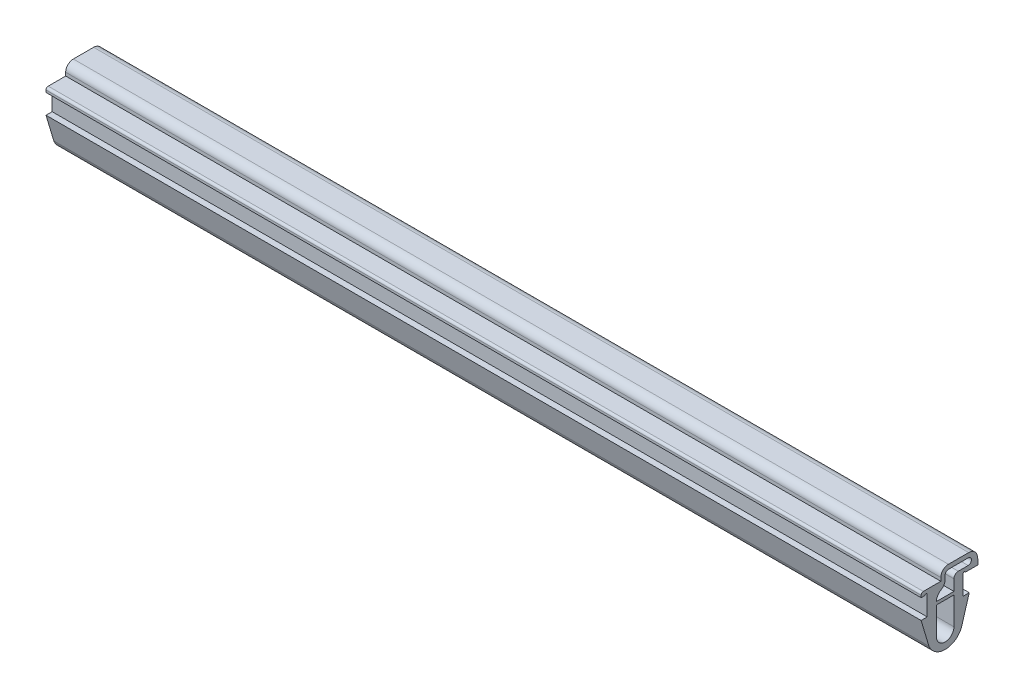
ISO-10303-21;
HEADER;
FILE_DESCRIPTION(('STEP AP214'),'2;1');
FILE_NAME('part.step','',(''),(''),'','','');
FILE_SCHEMA(('AUTOMOTIVE_DESIGN { 1 0 10303 214 1 1 1 1 }'));
ENDSEC;
DATA;
#1=APPLICATION_CONTEXT('core data for automotive mechanical design processes');
#2=APPLICATION_PROTOCOL_DEFINITION('international standard','automotive_design',2000,#1);
#3=PRODUCT_CONTEXT('',#1,'mechanical');
#4=PRODUCT('Part','Part','',(#3));
#5=PRODUCT_RELATED_PRODUCT_CATEGORY('part','',(#4));
#6=PRODUCT_DEFINITION_FORMATION('','',#4);
#7=PRODUCT_DEFINITION_CONTEXT('part definition',#1,'design');
#8=PRODUCT_DEFINITION('design','',#6,#7);
#9=PRODUCT_DEFINITION_SHAPE('','',#8);
#10=(LENGTH_UNIT() NAMED_UNIT(*) SI_UNIT(.MILLI.,.METRE.));
#11=(NAMED_UNIT(*) PLANE_ANGLE_UNIT() SI_UNIT($,.RADIAN.));
#12=(NAMED_UNIT(*) SI_UNIT($,.STERADIAN.) SOLID_ANGLE_UNIT());
#13=UNCERTAINTY_MEASURE_WITH_UNIT(LENGTH_MEASURE(1.E-05),#10,'distance_accuracy_value','');
#14=(GEOMETRIC_REPRESENTATION_CONTEXT(3) GLOBAL_UNCERTAINTY_ASSIGNED_CONTEXT((#13)) GLOBAL_UNIT_ASSIGNED_CONTEXT((#10,
#11,#12)) REPRESENTATION_CONTEXT('',''));
#15=CARTESIAN_POINT('',(0.,0.,0.));
#16=DIRECTION('',(0.,0.,1.));
#17=DIRECTION('',(1.,0.,0.));
#18=AXIS2_PLACEMENT_3D('',#15,#16,#17);
#19=CARTESIAN_POINT('',(200.,5.05334219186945,6.26221053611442));
#20=DIRECTION('',(-1.,0.,0.));
#21=DIRECTION('',(0.,0.,1.));
#22=AXIS2_PLACEMENT_3D('',#19,#20,#21);
#23=CYLINDRICAL_SURFACE('',#22,0.500000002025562);
#24=CARTESIAN_POINT('',(0.,5.05334219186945,6.26221053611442));
#25=DIRECTION('',(1.,0.,0.));
#26=DIRECTION('',(0.,0.,-1.));
#27=AXIS2_PLACEMENT_3D('',#24,#25,#26);
#28=CIRCLE('',#27,0.500000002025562);
#29=CARTESIAN_POINT('',(0.,5.55334219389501,6.26221053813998));
#30=VERTEX_POINT('',#29);
#31=CARTESIAN_POINT('',(0.,5.05334219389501,6.76221053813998));
#32=VERTEX_POINT('',#31);
#33=EDGE_CURVE('E427',#30,#32,#28,.T.);
#34=ORIENTED_EDGE('',*,*,#33,.T.);
#35=DIRECTION('',(-1.,0.,0.));
#36=VECTOR('',#35,1.);
#37=CARTESIAN_POINT('',(200.,5.05334219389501,6.76221053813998));
#38=LINE('',#37,#36);
#39=CARTESIAN_POINT('',(200.,5.05334219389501,6.76221053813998));
#40=VERTEX_POINT('',#39);
#41=EDGE_CURVE('E13',#40,#32,#38,.T.);
#42=ORIENTED_EDGE('',*,*,#41,.F.);
#43=CARTESIAN_POINT('',(200.,5.05334219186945,6.26221053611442));
#44=DIRECTION('',(1.,0.,0.));
#45=DIRECTION('',(0.,0.,-1.));
#46=AXIS2_PLACEMENT_3D('',#43,#44,#45);
#47=CIRCLE('',#46,0.500000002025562);
#48=CARTESIAN_POINT('',(200.,5.55334219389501,6.26221053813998));
#49=VERTEX_POINT('',#48);
#50=EDGE_CURVE('E660',#49,#40,#47,.T.);
#51=ORIENTED_EDGE('',*,*,#50,.F.);
#52=DIRECTION('',(-1.,0.,0.));
#53=VECTOR('',#52,1.);
#54=CARTESIAN_POINT('',(200.,5.55334219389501,6.26221053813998));
#55=LINE('',#54,#53);
#56=EDGE_CURVE('E486',#49,#30,#55,.T.);
#57=ORIENTED_EDGE('',*,*,#56,.T.);
#58=EDGE_LOOP('',(#34,#42,#51,#57));
#59=FACE_BOUND('',#58,.T.);
#60=ADVANCED_FACE('F110',(#59),#23,.T.);
#61=CARTESIAN_POINT('',(200.,5.05334219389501,6.76221053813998));
#62=DIRECTION('',(0.,0.,-1.));
#63=DIRECTION('',(-1.,0.,0.));
#64=AXIS2_PLACEMENT_3D('',#61,#62,#63);
#65=PLANE('',#64);
#66=DIRECTION('',(0.,-1.,0.));
#67=VECTOR('',#66,1.);
#68=CARTESIAN_POINT('',(0.,5.05334219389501,6.76221053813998));
#69=LINE('',#68,#67);
#70=CARTESIAN_POINT('',(0.,4.55334219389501,6.76221053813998));
#71=VERTEX_POINT('',#70);
#72=EDGE_CURVE('E431',#32,#71,#69,.T.);
#73=ORIENTED_EDGE('',*,*,#72,.T.);
#74=DIRECTION('',(-1.,0.,0.));
#75=VECTOR('',#74,1.);
#76=CARTESIAN_POINT('',(200.,4.55334219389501,6.76221053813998));
#77=LINE('',#76,#75);
#78=CARTESIAN_POINT('',(200.,4.55334219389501,6.76221053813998));
#79=VERTEX_POINT('',#78);
#80=EDGE_CURVE('E121',#79,#71,#77,.T.);
#81=ORIENTED_EDGE('',*,*,#80,.F.);
#82=DIRECTION('',(0.,-1.,0.));
#83=VECTOR('',#82,1.);
#84=CARTESIAN_POINT('',(200.,5.05334219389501,6.76221053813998));
#85=LINE('',#84,#83);
#86=EDGE_CURVE('E663',#40,#79,#85,.T.);
#87=ORIENTED_EDGE('',*,*,#86,.F.);
#88=ORIENTED_EDGE('',*,*,#41,.T.);
#89=EDGE_LOOP('',(#73,#81,#87,#88));
#90=FACE_BOUND('',#89,.T.);
#91=ADVANCED_FACE('F739',(#90),#65,.F.);
#92=CARTESIAN_POINT('',(200.,4.55334219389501,6.76221053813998));
#93=DIRECTION('',(0.,1.,0.));
#94=DIRECTION('',(0.,0.,1.));
#95=AXIS2_PLACEMENT_3D('',#92,#93,#94);
#96=PLANE('',#95);
#97=DIRECTION('',(0.,0.,-1.));
#98=VECTOR('',#97,1.);
#99=CARTESIAN_POINT('',(0.,4.55334219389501,6.76221053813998));
#100=LINE('',#99,#98);
#101=CARTESIAN_POINT('',(0.,4.55334219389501,5.86221639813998));
#102=VERTEX_POINT('',#101);
#103=EDGE_CURVE('E434',#71,#102,#100,.T.);
#104=ORIENTED_EDGE('',*,*,#103,.T.);
#105=DIRECTION('',(-1.,0.,0.));
#106=VECTOR('',#105,1.);
#107=CARTESIAN_POINT('',(200.,4.55334219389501,5.86221639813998));
#108=LINE('',#107,#106);
#109=CARTESIAN_POINT('',(200.,4.55334219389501,5.86221639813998));
#110=VERTEX_POINT('',#109);
#111=EDGE_CURVE('E546',#110,#102,#108,.T.);
#112=ORIENTED_EDGE('',*,*,#111,.F.);
#113=DIRECTION('',(0.,0.,-1.));
#114=VECTOR('',#113,1.);
#115=CARTESIAN_POINT('',(200.,4.55334219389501,6.76221053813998));
#116=LINE('',#115,#114);
#117=EDGE_CURVE('E666',#79,#110,#116,.T.);
#118=ORIENTED_EDGE('',*,*,#117,.F.);
#119=ORIENTED_EDGE('',*,*,#80,.T.);
#120=EDGE_LOOP('',(#104,#112,#118,#119));
#121=FACE_BOUND('',#120,.T.);
#122=ADVANCED_FACE('F744',(#121),#96,.F.);
#123=CARTESIAN_POINT('',(200.,4.55334219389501,5.61221639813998));
#124=DIRECTION('',(-1.,0.,0.));
#125=DIRECTION('',(0.,0.,1.));
#126=AXIS2_PLACEMENT_3D('',#123,#124,#125);
#127=CYLINDRICAL_SURFACE('',#126,0.249999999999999);
#128=CARTESIAN_POINT('',(0.,4.55334219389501,5.61221639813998));
#129=DIRECTION('',(-1.,0.,0.));
#130=DIRECTION('',(0.,0.,-1.));
#131=AXIS2_PLACEMENT_3D('',#128,#129,#130);
#132=CIRCLE('',#131,0.249999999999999);
#133=CARTESIAN_POINT('',(0.,4.55334219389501,5.36221639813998));
#134=VERTEX_POINT('',#133);
#135=EDGE_CURVE('E437',#102,#134,#132,.T.);
#136=ORIENTED_EDGE('',*,*,#135,.T.);
#137=DIRECTION('',(-1.,0.,0.));
#138=VECTOR('',#137,1.);
#139=CARTESIAN_POINT('',(200.,4.55334219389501,5.36221639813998));
#140=LINE('',#139,#138);
#141=CARTESIAN_POINT('',(200.,4.55334219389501,5.36221639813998));
#142=VERTEX_POINT('',#141);
#143=EDGE_CURVE('E542',#142,#134,#140,.T.);
#144=ORIENTED_EDGE('',*,*,#143,.F.);
#145=CARTESIAN_POINT('',(200.,4.55334219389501,5.61221639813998));
#146=DIRECTION('',(-1.,0.,0.));
#147=DIRECTION('',(0.,0.,-1.));
#148=AXIS2_PLACEMENT_3D('',#145,#146,#147);
#149=CIRCLE('',#148,0.249999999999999);
#150=EDGE_CURVE('E669',#110,#142,#149,.T.);
#151=ORIENTED_EDGE('',*,*,#150,.F.);
#152=ORIENTED_EDGE('',*,*,#111,.T.);
#153=EDGE_LOOP('',(#136,#144,#151,#152));
#154=FACE_BOUND('',#153,.T.);
#155=ADVANCED_FACE('F915',(#154),#127,.F.);
#156=CARTESIAN_POINT('',(200.,4.55334219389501,5.36221639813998));
#157=DIRECTION('',(0.,0.,-1.));
#158=DIRECTION('',(-1.,0.,0.));
#159=AXIS2_PLACEMENT_3D('',#156,#157,#158);
#160=PLANE('',#159);
#161=DIRECTION('',(0.,-1.,0.));
#162=VECTOR('',#161,1.);
#163=CARTESIAN_POINT('',(0.,4.55334219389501,5.36221639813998));
#164=LINE('',#163,#162);
#165=CARTESIAN_POINT('',(0.,0.0533421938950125,5.36221639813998));
#166=VERTEX_POINT('',#165);
#167=EDGE_CURVE('E440',#134,#166,#164,.T.);
#168=ORIENTED_EDGE('',*,*,#167,.T.);
#169=DIRECTION('',(-1.,0.,0.));
#170=VECTOR('',#169,1.);
#171=CARTESIAN_POINT('',(200.,0.0533421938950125,5.36221639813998));
#172=LINE('',#171,#170);
#173=CARTESIAN_POINT('',(200.,0.0533421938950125,5.36221639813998));
#174=VERTEX_POINT('',#173);
#175=EDGE_CURVE('E538',#174,#166,#172,.T.);
#176=ORIENTED_EDGE('',*,*,#175,.F.);
#177=DIRECTION('',(0.,-1.,0.));
#178=VECTOR('',#177,1.);
#179=CARTESIAN_POINT('',(200.,4.55334219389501,5.36221639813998));
#180=LINE('',#179,#178);
#181=EDGE_CURVE('E672',#142,#174,#180,.T.);
#182=ORIENTED_EDGE('',*,*,#181,.F.);
#183=ORIENTED_EDGE('',*,*,#143,.T.);
#184=EDGE_LOOP('',(#168,#176,#182,#183));
#185=FACE_BOUND('',#184,.T.);
#186=ADVANCED_FACE('F907',(#185),#160,.F.);
#187=CARTESIAN_POINT('',(200.,0.0533421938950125,5.36221639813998));
#188=DIRECTION('',(0.,-1.,0.));
#189=DIRECTION('',(0.,0.,-1.));
#190=AXIS2_PLACEMENT_3D('',#187,#188,#189);
#191=PLANE('',#190);
#192=DIRECTION('',(0.,0.,1.));
#193=VECTOR('',#192,1.);
#194=CARTESIAN_POINT('',(0.,0.0533421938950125,5.36221639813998));
#195=LINE('',#194,#193);
#196=CARTESIAN_POINT('',(0.,0.0533421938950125,6.76221029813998));
#197=VERTEX_POINT('',#196);
#198=EDGE_CURVE('E443',#166,#197,#195,.T.);
#199=ORIENTED_EDGE('',*,*,#198,.T.);
#200=DIRECTION('',(-1.,0.,0.));
#201=VECTOR('',#200,1.);
#202=CARTESIAN_POINT('',(200.,0.0533421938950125,6.76221029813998));
#203=LINE('',#202,#201);
#204=CARTESIAN_POINT('',(200.,0.0533421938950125,6.76221029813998));
#205=VERTEX_POINT('',#204);
#206=EDGE_CURVE('E534',#205,#197,#203,.T.);
#207=ORIENTED_EDGE('',*,*,#206,.F.);
#208=DIRECTION('',(0.,0.,1.));
#209=VECTOR('',#208,1.);
#210=CARTESIAN_POINT('',(200.,0.0533421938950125,5.36221639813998));
#211=LINE('',#210,#209);
#212=EDGE_CURVE('E675',#174,#205,#211,.T.);
#213=ORIENTED_EDGE('',*,*,#212,.F.);
#214=ORIENTED_EDGE('',*,*,#175,.T.);
#215=EDGE_LOOP('',(#199,#207,#213,#214));
#216=FACE_BOUND('',#215,.T.);
#217=ADVANCED_FACE('F899',(#216),#191,.F.);
#218=CARTESIAN_POINT('',(200.,0.0533421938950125,6.76221029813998));
#219=DIRECTION('',(0.,0.285855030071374,-0.958272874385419));
#220=DIRECTION('',(0.,0.95827287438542,0.285855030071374));
#221=AXIS2_PLACEMENT_3D('',#218,#219,#220);
#222=PLANE('',#221);
#223=DIRECTION('',(0.,-0.95827287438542,-0.285855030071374));
#224=VECTOR('',#223,1.);
#225=CARTESIAN_POINT('',(0.,0.0533421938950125,6.76221029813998));
#226=LINE('',#225,#224);
#227=CARTESIAN_POINT('',(0.,-5.92640706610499,4.97843716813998));
#228=VERTEX_POINT('',#227);
#229=EDGE_CURVE('E446',#197,#228,#226,.T.);
#230=ORIENTED_EDGE('',*,*,#229,.T.);
#231=DIRECTION('',(-1.,0.,0.));
#232=VECTOR('',#231,1.);
#233=CARTESIAN_POINT('',(200.,-5.92640706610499,4.97843716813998));
#234=LINE('',#233,#232);
#235=CARTESIAN_POINT('',(200.,-5.92640706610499,4.97843716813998));
#236=VERTEX_POINT('',#235);
#237=EDGE_CURVE('E530',#236,#228,#234,.T.);
#238=ORIENTED_EDGE('',*,*,#237,.F.);
#239=DIRECTION('',(0.,-0.95827287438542,-0.285855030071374));
#240=VECTOR('',#239,1.);
#241=CARTESIAN_POINT('',(200.,0.0533421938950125,6.76221029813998));
#242=LINE('',#241,#240);
#243=EDGE_CURVE('E678',#205,#236,#242,.T.);
#244=ORIENTED_EDGE('',*,*,#243,.F.);
#245=ORIENTED_EDGE('',*,*,#206,.T.);
#246=EDGE_LOOP('',(#230,#238,#244,#245));
#247=FACE_BOUND('',#246,.T.);
#248=ADVANCED_FACE('F891',(#247),#222,.F.);
#249=CARTESIAN_POINT('',(200.,-4.44665780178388,1.26221029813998));
#250=DIRECTION('',(-1.,0.,0.));
#251=DIRECTION('',(0.,0.,1.));
#252=AXIS2_PLACEMENT_3D('',#249,#250,#251);
#253=CYLINDRICAL_SURFACE('',#252,4.00000000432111);
#254=CARTESIAN_POINT('',(0.,-4.44665780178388,1.26221029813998));
#255=DIRECTION('',(1.,0.,0.));
#256=DIRECTION('',(0.,0.,-1.));
#257=AXIS2_PLACEMENT_3D('',#254,#255,#256);
#258=CIRCLE('',#257,4.00000000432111);
#259=CARTESIAN_POINT('',(0.,-5.92640706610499,-2.45401657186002));
#260=VERTEX_POINT('',#259);
#261=EDGE_CURVE('E449',#228,#260,#258,.T.);
#262=ORIENTED_EDGE('',*,*,#261,.T.);
#263=DIRECTION('',(-1.,0.,0.));
#264=VECTOR('',#263,1.);
#265=CARTESIAN_POINT('',(200.,-5.92640706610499,-2.45401657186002));
#266=LINE('',#265,#264);
#267=CARTESIAN_POINT('',(200.,-5.92640706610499,-2.45401657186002));
#268=VERTEX_POINT('',#267);
#269=EDGE_CURVE('E526',#268,#260,#266,.T.);
#270=ORIENTED_EDGE('',*,*,#269,.F.);
#271=CARTESIAN_POINT('',(200.,-4.44665780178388,1.26221029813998));
#272=DIRECTION('',(1.,0.,0.));
#273=DIRECTION('',(0.,0.,-1.));
#274=AXIS2_PLACEMENT_3D('',#271,#272,#273);
#275=CIRCLE('',#274,4.00000000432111);
#276=EDGE_CURVE('E681',#236,#268,#275,.T.);
#277=ORIENTED_EDGE('',*,*,#276,.F.);
#278=ORIENTED_EDGE('',*,*,#237,.T.);
#279=EDGE_LOOP('',(#262,#270,#277,#278));
#280=FACE_BOUND('',#279,.T.);
#281=ADVANCED_FACE('F883',(#280),#253,.T.);
#282=CARTESIAN_POINT('',(200.,-5.92640706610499,-2.45401657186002));
#283=DIRECTION('',(0.,0.285855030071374,0.95827287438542));
#284=DIRECTION('',(0.,-0.95827287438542,0.285855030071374));
#285=AXIS2_PLACEMENT_3D('',#282,#283,#284);
#286=PLANE('',#285);
#287=DIRECTION('',(0.,0.958272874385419,-0.285855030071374));
#288=VECTOR('',#287,1.);
#289=CARTESIAN_POINT('',(0.,-5.92640706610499,-2.45401657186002));
#290=LINE('',#289,#288);
#291=CARTESIAN_POINT('',(0.,0.0533421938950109,-4.23778970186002));
#292=VERTEX_POINT('',#291);
#293=EDGE_CURVE('E452',#260,#292,#290,.T.);
#294=ORIENTED_EDGE('',*,*,#293,.T.);
#295=DIRECTION('',(-1.,0.,0.));
#296=VECTOR('',#295,1.);
#297=CARTESIAN_POINT('',(200.,0.0533421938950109,-4.23778970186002));
#298=LINE('',#297,#296);
#299=CARTESIAN_POINT('',(200.,0.0533421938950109,-4.23778970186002));
#300=VERTEX_POINT('',#299);
#301=EDGE_CURVE('E522',#300,#292,#298,.T.);
#302=ORIENTED_EDGE('',*,*,#301,.F.);
#303=DIRECTION('',(0.,0.958272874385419,-0.285855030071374));
#304=VECTOR('',#303,1.);
#305=CARTESIAN_POINT('',(200.,-5.92640706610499,-2.45401657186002));
#306=LINE('',#305,#304);
#307=EDGE_CURVE('E684',#268,#300,#306,.T.);
#308=ORIENTED_EDGE('',*,*,#307,.F.);
#309=ORIENTED_EDGE('',*,*,#269,.T.);
#310=EDGE_LOOP('',(#294,#302,#308,#309));
#311=FACE_BOUND('',#310,.T.);
#312=ADVANCED_FACE('F875',(#311),#286,.F.);
#313=CARTESIAN_POINT('',(200.,0.0533421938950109,-4.23778970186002));
#314=DIRECTION('',(0.,-1.,0.));
#315=DIRECTION('',(0.,0.,-1.));
#316=AXIS2_PLACEMENT_3D('',#313,#314,#315);
#317=PLANE('',#316);
#318=DIRECTION('',(0.,0.,1.));
#319=VECTOR('',#318,1.);
#320=CARTESIAN_POINT('',(0.,0.0533421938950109,-4.23778970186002));
#321=LINE('',#320,#319);
#322=CARTESIAN_POINT('',(0.,0.0533421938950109,-2.83778817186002));
#323=VERTEX_POINT('',#322);
#324=EDGE_CURVE('E455',#292,#323,#321,.T.);
#325=ORIENTED_EDGE('',*,*,#324,.T.);
#326=DIRECTION('',(-1.,0.,0.));
#327=VECTOR('',#326,1.);
#328=CARTESIAN_POINT('',(200.,0.0533421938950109,-2.83778817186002));
#329=LINE('',#328,#327);
#330=CARTESIAN_POINT('',(200.,0.0533421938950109,-2.83778817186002));
#331=VERTEX_POINT('',#330);
#332=EDGE_CURVE('E518',#331,#323,#329,.T.);
#333=ORIENTED_EDGE('',*,*,#332,.F.);
#334=DIRECTION('',(0.,0.,1.));
#335=VECTOR('',#334,1.);
#336=CARTESIAN_POINT('',(200.,0.0533421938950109,-4.23778970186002));
#337=LINE('',#336,#335);
#338=EDGE_CURVE('E687',#300,#331,#337,.T.);
#339=ORIENTED_EDGE('',*,*,#338,.F.);
#340=ORIENTED_EDGE('',*,*,#301,.T.);
#341=EDGE_LOOP('',(#325,#333,#339,#340));
#342=FACE_BOUND('',#341,.T.);
#343=ADVANCED_FACE('F867',(#342),#317,.F.);
#344=CARTESIAN_POINT('',(200.,0.0533421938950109,-2.83778817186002));
#345=DIRECTION('',(0.,1.58888888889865E-06,0.999999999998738));
#346=DIRECTION('',(0.,-0.999999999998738,1.58888888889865E-06));
#347=AXIS2_PLACEMENT_3D('',#344,#345,#346);
#348=PLANE('',#347);
#349=DIRECTION('',(0.,0.999999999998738,-1.58888888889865E-06));
#350=VECTOR('',#349,1.);
#351=CARTESIAN_POINT('',(0.,0.0533421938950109,-2.83778817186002));
#352=LINE('',#351,#350);
#353=CARTESIAN_POINT('',(0.,4.55334219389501,-2.83779532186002));
#354=VERTEX_POINT('',#353);
#355=EDGE_CURVE('E458',#323,#354,#352,.T.);
#356=ORIENTED_EDGE('',*,*,#355,.T.);
#357=DIRECTION('',(-1.,0.,0.));
#358=VECTOR('',#357,1.);
#359=CARTESIAN_POINT('',(200.,4.55334219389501,-2.83779532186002));
#360=LINE('',#359,#358);
#361=CARTESIAN_POINT('',(200.,4.55334219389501,-2.83779532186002));
#362=VERTEX_POINT('',#361);
#363=EDGE_CURVE('E514',#362,#354,#360,.T.);
#364=ORIENTED_EDGE('',*,*,#363,.F.);
#365=DIRECTION('',(0.,0.999999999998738,-1.58888888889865E-06));
#366=VECTOR('',#365,1.);
#367=CARTESIAN_POINT('',(200.,0.0533421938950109,-2.83778817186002));
#368=LINE('',#367,#366);
#369=EDGE_CURVE('E690',#331,#362,#368,.T.);
#370=ORIENTED_EDGE('',*,*,#369,.F.);
#371=ORIENTED_EDGE('',*,*,#332,.T.);
#372=EDGE_LOOP('',(#356,#364,#370,#371));
#373=FACE_BOUND('',#372,.T.);
#374=ADVANCED_FACE('F859',(#373),#348,.F.);
#375=CARTESIAN_POINT('',(200.,4.55334219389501,-3.08779532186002));
#376=DIRECTION('',(-1.,0.,0.));
#377=DIRECTION('',(0.,0.,1.));
#378=AXIS2_PLACEMENT_3D('',#375,#376,#377);
#379=CYLINDRICAL_SURFACE('',#378,0.25);
#380=CARTESIAN_POINT('',(0.,4.55334219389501,-3.08779532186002));
#381=DIRECTION('',(-1.,0.,0.));
#382=DIRECTION('',(0.,0.,-1.));
#383=AXIS2_PLACEMENT_3D('',#380,#381,#382);
#384=CIRCLE('',#383,0.25);
#385=CARTESIAN_POINT('',(0.,4.55334219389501,-3.33779532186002));
#386=VERTEX_POINT('',#385);
#387=EDGE_CURVE('E461',#354,#386,#384,.T.);
#388=ORIENTED_EDGE('',*,*,#387,.T.);
#389=DIRECTION('',(-1.,0.,0.));
#390=VECTOR('',#389,1.);
#391=CARTESIAN_POINT('',(200.,4.55334219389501,-3.33779532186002));
#392=LINE('',#391,#390);
#393=CARTESIAN_POINT('',(200.,4.55334219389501,-3.33779532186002));
#394=VERTEX_POINT('',#393);
#395=EDGE_CURVE('E510',#394,#386,#392,.T.);
#396=ORIENTED_EDGE('',*,*,#395,.F.);
#397=CARTESIAN_POINT('',(200.,4.55334219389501,-3.08779532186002));
#398=DIRECTION('',(-1.,0.,0.));
#399=DIRECTION('',(0.,0.,-1.));
#400=AXIS2_PLACEMENT_3D('',#397,#398,#399);
#401=CIRCLE('',#400,0.25);
#402=EDGE_CURVE('E693',#362,#394,#401,.T.);
#403=ORIENTED_EDGE('',*,*,#402,.F.);
#404=ORIENTED_EDGE('',*,*,#363,.T.);
#405=EDGE_LOOP('',(#388,#396,#403,#404));
#406=FACE_BOUND('',#405,.T.);
#407=ADVANCED_FACE('F851',(#406),#379,.F.);
#408=CARTESIAN_POINT('',(200.,4.55334219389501,-3.33779532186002));
#409=DIRECTION('',(0.,1.,0.));
#410=DIRECTION('',(0.,0.,1.));
#411=AXIS2_PLACEMENT_3D('',#408,#409,#410);
#412=PLANE('',#411);
#413=DIRECTION('',(0.,0.,-1.));
#414=VECTOR('',#413,1.);
#415=CARTESIAN_POINT('',(0.,4.55334219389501,-3.33779532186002));
#416=LINE('',#415,#414);
#417=CARTESIAN_POINT('',(0.,4.55334219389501,-6.23778947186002));
#418=VERTEX_POINT('',#417);
#419=EDGE_CURVE('E464',#386,#418,#416,.T.);
#420=ORIENTED_EDGE('',*,*,#419,.T.);
#421=DIRECTION('',(-1.,0.,0.));
#422=VECTOR('',#421,1.);
#423=CARTESIAN_POINT('',(200.,4.55334219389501,-6.23778947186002));
#424=LINE('',#423,#422);
#425=CARTESIAN_POINT('',(200.,4.55334219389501,-6.23778947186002));
#426=VERTEX_POINT('',#425);
#427=EDGE_CURVE('E506',#426,#418,#424,.T.);
#428=ORIENTED_EDGE('',*,*,#427,.F.);
#429=DIRECTION('',(0.,0.,-1.));
#430=VECTOR('',#429,1.);
#431=CARTESIAN_POINT('',(200.,4.55334219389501,-3.33779532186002));
#432=LINE('',#431,#430);
#433=EDGE_CURVE('E696',#394,#426,#432,.T.);
#434=ORIENTED_EDGE('',*,*,#433,.F.);
#435=ORIENTED_EDGE('',*,*,#395,.T.);
#436=EDGE_LOOP('',(#420,#428,#434,#435));
#437=FACE_BOUND('',#436,.T.);
#438=ADVANCED_FACE('F843',(#437),#412,.F.);
#439=CARTESIAN_POINT('',(200.,4.55334219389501,-6.23778947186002));
#440=DIRECTION('',(0.,2.40000000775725E-07,0.999999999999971));
#441=DIRECTION('',(0.,-0.999999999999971,2.40000000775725E-07));
#442=AXIS2_PLACEMENT_3D('',#439,#440,#441);
#443=PLANE('',#442);
#444=DIRECTION('',(0.,0.999999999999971,-2.40000000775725E-07));
#445=VECTOR('',#444,1.);
#446=CARTESIAN_POINT('',(0.,4.55334219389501,-6.23778947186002));
#447=LINE('',#446,#445);
#448=CARTESIAN_POINT('',(0.,5.55334219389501,-6.23778971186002));
#449=VERTEX_POINT('',#448);
#450=EDGE_CURVE('E467',#418,#449,#447,.T.);
#451=ORIENTED_EDGE('',*,*,#450,.T.);
#452=DIRECTION('',(-1.,0.,0.));
#453=VECTOR('',#452,1.);
#454=CARTESIAN_POINT('',(200.,5.55334219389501,-6.23778971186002));
#455=LINE('',#454,#453);
#456=CARTESIAN_POINT('',(200.,5.55334219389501,-6.23778971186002));
#457=VERTEX_POINT('',#456);
#458=EDGE_CURVE('E502',#457,#449,#455,.T.);
#459=ORIENTED_EDGE('',*,*,#458,.F.);
#460=DIRECTION('',(0.,0.999999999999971,-2.40000000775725E-07));
#461=VECTOR('',#460,1.);
#462=CARTESIAN_POINT('',(200.,4.55334219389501,-6.23778947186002));
#463=LINE('',#462,#461);
#464=EDGE_CURVE('E699',#426,#457,#463,.T.);
#465=ORIENTED_EDGE('',*,*,#464,.F.);
#466=ORIENTED_EDGE('',*,*,#427,.T.);
#467=EDGE_LOOP('',(#451,#459,#465,#466));
#468=FACE_BOUND('',#467,.T.);
#469=ADVANCED_FACE('F835',(#468),#443,.F.);
#470=CARTESIAN_POINT('',(200.,5.55334219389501,-6.23778971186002));
#471=DIRECTION('',(0.,-0.173648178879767,0.984807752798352));
#472=DIRECTION('',(0.,-0.984807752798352,-0.173648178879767));
#473=AXIS2_PLACEMENT_3D('',#470,#471,#472);
#474=PLANE('',#473);
#475=DIRECTION('',(0.,0.984807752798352,0.173648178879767));
#476=VECTOR('',#475,1.);
#477=CARTESIAN_POINT('',(0.,5.55334219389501,-6.23778971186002));
#478=LINE('',#477,#476);
#479=CARTESIAN_POINT('',(0.,6.40063855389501,-6.08838850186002));
#480=VERTEX_POINT('',#479);
#481=EDGE_CURVE('E470',#449,#480,#478,.T.);
#482=ORIENTED_EDGE('',*,*,#481,.T.);
#483=DIRECTION('',(-1.,0.,0.));
#484=VECTOR('',#483,1.);
#485=CARTESIAN_POINT('',(200.,6.40063855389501,-6.08838850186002));
#486=LINE('',#485,#484);
#487=CARTESIAN_POINT('',(200.,6.40063855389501,-6.08838850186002));
#488=VERTEX_POINT('',#487);
#489=EDGE_CURVE('E498',#488,#480,#486,.T.);
#490=ORIENTED_EDGE('',*,*,#489,.F.);
#491=DIRECTION('',(0.,0.984807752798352,0.173648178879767));
#492=VECTOR('',#491,1.);
#493=CARTESIAN_POINT('',(200.,5.55334219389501,-6.23778971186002));
#494=LINE('',#493,#492);
#495=EDGE_CURVE('E702',#457,#488,#494,.T.);
#496=ORIENTED_EDGE('',*,*,#495,.F.);
#497=ORIENTED_EDGE('',*,*,#458,.T.);
#498=EDGE_LOOP('',(#482,#490,#496,#497));
#499=FACE_BOUND('',#498,.T.);
#500=ADVANCED_FACE('F828',(#499),#474,.F.);
#501=CARTESIAN_POINT('',(200.,6.05334219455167,-4.11877299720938));
#502=DIRECTION('',(-1.,0.,0.));
#503=DIRECTION('',(0.,0.,1.));
#504=AXIS2_PLACEMENT_3D('',#501,#502,#503);
#505=CYLINDRICAL_SURFACE('',#504,1.99999999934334);
#506=CARTESIAN_POINT('',(0.,6.05334219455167,-4.11877299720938));
#507=DIRECTION('',(1.,0.,0.));
#508=DIRECTION('',(0.,0.,-1.));
#509=AXIS2_PLACEMENT_3D('',#506,#507,#508);
#510=CIRCLE('',#509,1.99999999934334);
#511=CARTESIAN_POINT('',(0.,8.05334219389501,-4.11877299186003));
#512=VERTEX_POINT('',#511);
#513=EDGE_CURVE('E473',#480,#512,#510,.T.);
#514=ORIENTED_EDGE('',*,*,#513,.T.);
#515=DIRECTION('',(-1.,0.,0.));
#516=VECTOR('',#515,1.);
#517=CARTESIAN_POINT('',(200.,8.05334219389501,-4.11877299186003));
#518=LINE('',#517,#516);
#519=CARTESIAN_POINT('',(200.,8.05334219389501,-4.11877299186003));
#520=VERTEX_POINT('',#519);
#521=EDGE_CURVE('E494',#520,#512,#518,.T.);
#522=ORIENTED_EDGE('',*,*,#521,.F.);
#523=CARTESIAN_POINT('',(200.,6.05334219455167,-4.11877299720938));
#524=DIRECTION('',(1.,0.,0.));
#525=DIRECTION('',(0.,0.,-1.));
#526=AXIS2_PLACEMENT_3D('',#523,#524,#525);
#527=CIRCLE('',#526,1.99999999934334);
#528=EDGE_CURVE('E705',#488,#520,#527,.T.);
#529=ORIENTED_EDGE('',*,*,#528,.F.);
#530=ORIENTED_EDGE('',*,*,#489,.T.);
#531=EDGE_LOOP('',(#514,#522,#529,#530));
#532=FACE_BOUND('',#531,.T.);
#533=ADVANCED_FACE('F713',(#532),#505,.T.);
#534=CARTESIAN_POINT('',(200.,8.05334219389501,-4.11877299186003));
#535=DIRECTION('',(0.,-1.,0.));
#536=DIRECTION('',(0.,0.,-1.));
#537=AXIS2_PLACEMENT_3D('',#534,#535,#536);
#538=PLANE('',#537);
#539=DIRECTION('',(0.,0.,1.));
#540=VECTOR('',#539,1.);
#541=CARTESIAN_POINT('',(0.,8.05334219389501,-4.11877299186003));
#542=LINE('',#541,#540);
#543=CARTESIAN_POINT('',(0.,8.05334219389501,0.512210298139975));
#544=VERTEX_POINT('',#543);
#545=EDGE_CURVE('E476',#512,#544,#542,.T.);
#546=ORIENTED_EDGE('',*,*,#545,.T.);
#547=DIRECTION('',(-1.,0.,0.));
#548=VECTOR('',#547,1.);
#549=CARTESIAN_POINT('',(200.,8.05334219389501,0.512210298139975));
#550=LINE('',#549,#548);
#551=CARTESIAN_POINT('',(200.,8.05334219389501,0.512210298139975));
#552=VERTEX_POINT('',#551);
#553=EDGE_CURVE('E360',#552,#544,#550,.T.);
#554=ORIENTED_EDGE('',*,*,#553,.F.);
#555=DIRECTION('',(0.,0.,1.));
#556=VECTOR('',#555,1.);
#557=CARTESIAN_POINT('',(200.,8.05334219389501,-4.11877299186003));
#558=LINE('',#557,#556);
#559=EDGE_CURVE('E349',#520,#552,#558,.T.);
#560=ORIENTED_EDGE('',*,*,#559,.F.);
#561=ORIENTED_EDGE('',*,*,#521,.T.);
#562=EDGE_LOOP('',(#546,#554,#560,#561));
#563=FACE_BOUND('',#562,.T.);
#564=ADVANCED_FACE('F717',(#563),#538,.F.);
#565=CARTESIAN_POINT('',(200.,6.3033422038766,0.51221030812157));
#566=DIRECTION('',(-1.,0.,0.));
#567=DIRECTION('',(0.,0.,1.));
#568=AXIS2_PLACEMENT_3D('',#565,#566,#567);
#569=CYLINDRICAL_SURFACE('',#568,1.74999999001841);
#570=CARTESIAN_POINT('',(0.,6.3033422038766,0.51221030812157));
#571=DIRECTION('',(1.,0.,0.));
#572=DIRECTION('',(0.,0.,-1.));
#573=AXIS2_PLACEMENT_3D('',#570,#571,#572);
#574=CIRCLE('',#573,1.74999999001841);
#575=CARTESIAN_POINT('',(0.,6.30334219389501,2.26221029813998));
#576=VERTEX_POINT('',#575);
#577=EDGE_CURVE('E358',#544,#576,#574,.T.);
#578=ORIENTED_EDGE('',*,*,#577,.T.);
#579=DIRECTION('',(-1.,0.,0.));
#580=VECTOR('',#579,1.);
#581=CARTESIAN_POINT('',(200.,6.30334219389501,2.26221029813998));
#582=LINE('',#581,#580);
#583=CARTESIAN_POINT('',(200.,6.30334219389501,2.26221029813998));
#584=VERTEX_POINT('',#583);
#585=EDGE_CURVE('E355',#584,#576,#582,.T.);
#586=ORIENTED_EDGE('',*,*,#585,.F.);
#587=CARTESIAN_POINT('',(200.,6.3033422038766,0.51221030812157));
#588=DIRECTION('',(1.,0.,0.));
#589=DIRECTION('',(0.,0.,-1.));
#590=AXIS2_PLACEMENT_3D('',#587,#588,#589);
#591=CIRCLE('',#590,1.74999999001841);
#592=EDGE_CURVE('E343',#552,#584,#591,.T.);
#593=ORIENTED_EDGE('',*,*,#592,.F.);
#594=ORIENTED_EDGE('',*,*,#553,.T.);
#595=EDGE_LOOP('',(#578,#586,#593,#594));
#596=FACE_BOUND('',#595,.T.);
#597=ADVANCED_FACE('F356',(#596),#569,.T.);
#598=CARTESIAN_POINT('',(200.,6.30334219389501,2.26221029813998));
#599=DIRECTION('',(0.,0.,-1.));
#600=DIRECTION('',(-1.,0.,0.));
#601=AXIS2_PLACEMENT_3D('',#598,#599,#600);
#602=PLANE('',#601);
#603=DIRECTION('',(0.,-1.,0.));
#604=VECTOR('',#603,1.);
#605=CARTESIAN_POINT('',(0.,6.30334219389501,2.26221029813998));
#606=LINE('',#605,#604);
#607=CARTESIAN_POINT('',(0.,5.55334219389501,2.26221029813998));
#608=VERTEX_POINT('',#607);
#609=EDGE_CURVE('E237',#576,#608,#606,.T.);
#610=ORIENTED_EDGE('',*,*,#609,.T.);
#611=DIRECTION('',(-1.,0.,0.));
#612=VECTOR('',#611,1.);
#613=CARTESIAN_POINT('',(200.,5.55334219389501,2.26221029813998));
#614=LINE('',#613,#612);
#615=CARTESIAN_POINT('',(200.,5.55334219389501,2.26221029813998));
#616=VERTEX_POINT('',#615);
#617=EDGE_CURVE('E361',#616,#608,#614,.T.);
#618=ORIENTED_EDGE('',*,*,#617,.F.);
#619=DIRECTION('',(0.,-1.,0.));
#620=VECTOR('',#619,1.);
#621=CARTESIAN_POINT('',(200.,6.30334219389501,2.26221029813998));
#622=LINE('',#621,#620);
#623=EDGE_CURVE('E347',#584,#616,#622,.T.);
#624=ORIENTED_EDGE('',*,*,#623,.F.);
#625=ORIENTED_EDGE('',*,*,#585,.T.);
#626=EDGE_LOOP('',(#610,#618,#624,#625));
#627=FACE_BOUND('',#626,.T.);
#628=ADVANCED_FACE('F363',(#627),#602,.F.);
#629=CARTESIAN_POINT('',(200.,-4.94665780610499,1.26221029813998));
#630=DIRECTION('',(-1.,0.,0.));
#631=DIRECTION('',(0.,0.,1.));
#632=AXIS2_PLACEMENT_3D('',#629,#630,#631);
#633=CYLINDRICAL_SURFACE('',#632,2.);
#634=CARTESIAN_POINT('',(0.,-4.94665780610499,1.26221029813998));
#635=DIRECTION('',(1.,0.,0.));
#636=DIRECTION('',(0.,0.,-1.));
#637=AXIS2_PLACEMENT_3D('',#634,#635,#636);
#638=CIRCLE('',#637,2.);
#639=CARTESIAN_POINT('',(0.,-4.94665780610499,3.26221029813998));
#640=VERTEX_POINT('',#639);
#641=CARTESIAN_POINT('',(0.,-4.94665780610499,-0.737789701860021));
#642=VERTEX_POINT('',#641);
#643=EDGE_CURVE('E411',#640,#642,#638,.T.);
#644=ORIENTED_EDGE('',*,*,#643,.F.);
#645=DIRECTION('',(-1.,0.,0.));
#646=VECTOR('',#645,1.);
#647=CARTESIAN_POINT('',(200.,-4.94665780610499,3.26221029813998));
#648=LINE('',#647,#646);
#649=CARTESIAN_POINT('',(200.,-4.94665780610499,3.26221029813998));
#650=VERTEX_POINT('',#649);
#651=EDGE_CURVE('E489',#650,#640,#648,.T.);
#652=ORIENTED_EDGE('',*,*,#651,.F.);
#653=CARTESIAN_POINT('',(200.,-4.94665780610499,1.26221029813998));
#654=DIRECTION('',(1.,0.,0.));
#655=DIRECTION('',(0.,0.,-1.));
#656=AXIS2_PLACEMENT_3D('',#653,#654,#655);
#657=CIRCLE('',#656,2.);
#658=CARTESIAN_POINT('',(200.,-4.94665780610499,-0.737789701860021));
#659=VERTEX_POINT('',#658);
#660=EDGE_CURVE('E644',#650,#659,#657,.T.);
#661=ORIENTED_EDGE('',*,*,#660,.T.);
#662=DIRECTION('',(-1.,0.,0.));
#663=VECTOR('',#662,1.);
#664=CARTESIAN_POINT('',(200.,-4.94665780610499,-0.737789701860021));
#665=LINE('',#664,#663);
#666=EDGE_CURVE('E553',#659,#642,#665,.T.);
#667=ORIENTED_EDGE('',*,*,#666,.T.);
#668=EDGE_LOOP('',(#644,#652,#661,#667));
#669=FACE_BOUND('',#668,.T.);
#670=ADVANCED_FACE('F760',(#669),#633,.F.);
#671=CARTESIAN_POINT('',(200.,-4.94665780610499,3.26221029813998));
#672=DIRECTION('',(0.,0.,-1.));
#673=DIRECTION('',(-1.,0.,0.));
#674=AXIS2_PLACEMENT_3D('',#671,#672,#673);
#675=PLANE('',#674);
#676=DIRECTION('',(0.,-1.,0.));
#677=VECTOR('',#676,1.);
#678=CARTESIAN_POINT('',(0.,-4.94665780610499,3.26221029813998));
#679=LINE('',#678,#677);
#680=CARTESIAN_POINT('',(0.,1.36187868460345,3.26221029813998));
#681=VERTEX_POINT('',#680);
#682=EDGE_CURVE('E415',#681,#640,#679,.T.);
#683=ORIENTED_EDGE('',*,*,#682,.F.);
#684=DIRECTION('',(-1.,0.,0.));
#685=VECTOR('',#684,1.);
#686=CARTESIAN_POINT('',(200.,1.36187868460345,3.26221029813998));
#687=LINE('',#686,#685);
#688=CARTESIAN_POINT('',(200.,1.36187868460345,3.26221029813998));
#689=VERTEX_POINT('',#688);
#690=EDGE_CURVE('E559',#689,#681,#687,.T.);
#691=ORIENTED_EDGE('',*,*,#690,.F.);
#692=DIRECTION('',(0.,-1.,0.));
#693=VECTOR('',#692,1.);
#694=CARTESIAN_POINT('',(200.,-4.94665780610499,3.26221029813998));
#695=LINE('',#694,#693);
#696=EDGE_CURVE('E648',#689,#650,#695,.T.);
#697=ORIENTED_EDGE('',*,*,#696,.T.);
#698=ORIENTED_EDGE('',*,*,#651,.T.);
#699=EDGE_LOOP('',(#683,#691,#697,#698));
#700=FACE_BOUND('',#699,.T.);
#701=ADVANCED_FACE('F756',(#700),#675,.T.);
#702=CARTESIAN_POINT('',(200.,1.36187868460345,3.26221029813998));
#703=DIRECTION('',(0.,-1.,0.));
#704=DIRECTION('',(0.,0.,-1.));
#705=AXIS2_PLACEMENT_3D('',#702,#703,#704);
#706=PLANE('',#705);
#707=DIRECTION('',(0.,0.,1.));
#708=VECTOR('',#707,1.);
#709=CARTESIAN_POINT('',(0.,1.36187868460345,3.26221029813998));
#710=LINE('',#709,#708);
#711=CARTESIAN_POINT('',(0.,1.36187868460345,-0.737789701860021));
#712=VERTEX_POINT('',#711);
#713=EDGE_CURVE('E419',#712,#681,#710,.T.);
#714=ORIENTED_EDGE('',*,*,#713,.F.);
#715=DIRECTION('',(-1.,0.,0.));
#716=VECTOR('',#715,1.);
#717=CARTESIAN_POINT('',(200.,1.36187868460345,-0.737789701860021));
#718=LINE('',#717,#716);
#719=CARTESIAN_POINT('',(200.,1.36187868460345,-0.737789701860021));
#720=VERTEX_POINT('',#719);
#721=EDGE_CURVE('E556',#720,#712,#718,.T.);
#722=ORIENTED_EDGE('',*,*,#721,.F.);
#723=DIRECTION('',(0.,0.,1.));
#724=VECTOR('',#723,1.);
#725=CARTESIAN_POINT('',(200.,1.36187868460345,3.26221029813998));
#726=LINE('',#725,#724);
#727=EDGE_CURVE('E652',#720,#689,#726,.T.);
#728=ORIENTED_EDGE('',*,*,#727,.T.);
#729=ORIENTED_EDGE('',*,*,#690,.T.);
#730=EDGE_LOOP('',(#714,#722,#728,#729));
#731=FACE_BOUND('',#730,.T.);
#732=ADVANCED_FACE('F753',(#731),#706,.T.);
#733=CARTESIAN_POINT('',(200.,4.55334218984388,-1.73778970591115));
#734=DIRECTION('',(-1.,0.,0.));
#735=DIRECTION('',(0.,0.,1.));
#736=AXIS2_PLACEMENT_3D('',#733,#734,#735);
#737=CYLINDRICAL_SURFACE('',#736,1.00000000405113);
#738=CARTESIAN_POINT('',(0.,4.55334218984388,-1.73778970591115));
#739=DIRECTION('',(-1.,0.,0.));
#740=DIRECTION('',(0.,0.,-1.));
#741=AXIS2_PLACEMENT_3D('',#738,#739,#740);
#742=CIRCLE('',#741,1.00000000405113);
#743=CARTESIAN_POINT('',(0.,4.55334219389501,-0.737789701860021));
#744=VERTEX_POINT('',#743);
#745=CARTESIAN_POINT('',(0.,5.55334219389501,-1.73778970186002));
#746=VERTEX_POINT('',#745);
#747=EDGE_CURVE('E371',#744,#746,#742,.T.);
#748=ORIENTED_EDGE('',*,*,#747,.F.);
#749=DIRECTION('',(-1.,0.,0.));
#750=VECTOR('',#749,1.);
#751=CARTESIAN_POINT('',(200.,4.55334219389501,-0.737789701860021));
#752=LINE('',#751,#750);
#753=CARTESIAN_POINT('',(200.,4.55334219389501,-0.737789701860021));
#754=VERTEX_POINT('',#753);
#755=EDGE_CURVE('E114',#754,#744,#752,.T.);
#756=ORIENTED_EDGE('',*,*,#755,.F.);
#757=CARTESIAN_POINT('',(200.,4.55334218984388,-1.73778970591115));
#758=DIRECTION('',(-1.,0.,0.));
#759=DIRECTION('',(0.,0.,-1.));
#760=AXIS2_PLACEMENT_3D('',#757,#758,#759);
#761=CIRCLE('',#760,1.00000000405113);
#762=CARTESIAN_POINT('',(200.,5.55334219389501,-1.73778970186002));
#763=VERTEX_POINT('',#762);
#764=EDGE_CURVE('E485',#754,#763,#761,.T.);
#765=ORIENTED_EDGE('',*,*,#764,.T.);
#766=DIRECTION('',(-1.,0.,0.));
#767=VECTOR('',#766,1.);
#768=CARTESIAN_POINT('',(200.,5.55334219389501,-1.73778970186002));
#769=LINE('',#768,#767);
#770=EDGE_CURVE('E367',#763,#746,#769,.T.);
#771=ORIENTED_EDGE('',*,*,#770,.T.);
#772=EDGE_LOOP('',(#748,#756,#765,#771));
#773=FACE_BOUND('',#772,.T.);
#774=ADVANCED_FACE('F112',(#773),#737,.T.);
#775=CARTESIAN_POINT('',(200.,4.55334219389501,-0.737789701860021));
#776=DIRECTION('',(0.,0.,1.));
#777=DIRECTION('',(0.,-1.,0.));
#778=AXIS2_PLACEMENT_3D('',#775,#776,#777);
#779=PLANE('',#778);
#780=DIRECTION('',(0.,1.,0.));
#781=VECTOR('',#780,1.);
#782=CARTESIAN_POINT('',(0.,4.55334219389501,-0.737789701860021));
#783=LINE('',#782,#781);
#784=CARTESIAN_POINT('',(0.,2.0533421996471,-0.737789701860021));
#785=VERTEX_POINT('',#784);
#786=EDGE_CURVE('E375',#785,#744,#783,.T.);
#787=ORIENTED_EDGE('',*,*,#786,.F.);
#788=DIRECTION('',(-1.,0.,0.));
#789=VECTOR('',#788,1.);
#790=CARTESIAN_POINT('',(200.,2.0533421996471,-0.737789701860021));
#791=LINE('',#790,#789);
#792=CARTESIAN_POINT('',(200.,2.0533421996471,-0.737789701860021));
#793=VERTEX_POINT('',#792);
#794=EDGE_CURVE('E586',#793,#785,#791,.T.);
#795=ORIENTED_EDGE('',*,*,#794,.F.);
#796=DIRECTION('',(0.,1.,0.));
#797=VECTOR('',#796,1.);
#798=CARTESIAN_POINT('',(200.,4.55334219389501,-0.737789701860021));
#799=LINE('',#798,#797);
#800=EDGE_CURVE('E597',#793,#754,#799,.T.);
#801=ORIENTED_EDGE('',*,*,#800,.T.);
#802=ORIENTED_EDGE('',*,*,#755,.T.);
#803=EDGE_LOOP('',(#787,#795,#801,#802));
#804=FACE_BOUND('',#803,.T.);
#805=ADVANCED_FACE('F595',(#804),#779,.T.);
#806=CARTESIAN_POINT('',(200.,2.0533421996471,3.26221029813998));
#807=DIRECTION('',(0.,1.,0.));
#808=DIRECTION('',(0.,0.,1.));
#809=AXIS2_PLACEMENT_3D('',#806,#807,#808);
#810=PLANE('',#809);
#811=DIRECTION('',(0.,0.,-1.));
#812=VECTOR('',#811,1.);
#813=CARTESIAN_POINT('',(0.,2.0533421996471,3.26221029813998));
#814=LINE('',#813,#812);
#815=CARTESIAN_POINT('',(0.,2.0533421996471,3.26221029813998));
#816=VERTEX_POINT('',#815);
#817=EDGE_CURVE('E379',#816,#785,#814,.T.);
#818=ORIENTED_EDGE('',*,*,#817,.F.);
#819=DIRECTION('',(-1.,0.,0.));
#820=VECTOR('',#819,1.);
#821=CARTESIAN_POINT('',(200.,2.0533421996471,3.26221029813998));
#822=LINE('',#821,#820);
#823=CARTESIAN_POINT('',(200.,2.0533421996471,3.26221029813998));
#824=VERTEX_POINT('',#823);
#825=EDGE_CURVE('E584',#824,#816,#822,.T.);
#826=ORIENTED_EDGE('',*,*,#825,.F.);
#827=DIRECTION('',(0.,0.,-1.));
#828=VECTOR('',#827,1.);
#829=CARTESIAN_POINT('',(200.,2.0533421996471,3.26221029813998));
#830=LINE('',#829,#828);
#831=EDGE_CURVE('E605',#824,#793,#830,.T.);
#832=ORIENTED_EDGE('',*,*,#831,.T.);
#833=ORIENTED_EDGE('',*,*,#794,.T.);
#834=EDGE_LOOP('',(#818,#826,#832,#833));
#835=FACE_BOUND('',#834,.T.);
#836=ADVANCED_FACE('F603',(#835),#810,.T.);
#837=CARTESIAN_POINT('',(200.,2.0533421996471,1.26221030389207));
#838=DIRECTION('',(-1.,0.,0.));
#839=DIRECTION('',(0.,0.,1.));
#840=AXIS2_PLACEMENT_3D('',#837,#838,#839);
#841=CYLINDRICAL_SURFACE('',#840,1.99999999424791);
#842=CARTESIAN_POINT('',(0.,2.0533421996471,1.26221030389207));
#843=DIRECTION('',(1.,0.,0.));
#844=DIRECTION('',(0.,0.,-1.));
#845=AXIS2_PLACEMENT_3D('',#842,#843,#844);
#846=CIRCLE('',#845,1.99999999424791);
#847=CARTESIAN_POINT('',(0.,3.78539300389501,2.26221029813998));
#848=VERTEX_POINT('',#847);
#849=EDGE_CURVE('E383',#848,#816,#846,.T.);
#850=ORIENTED_EDGE('',*,*,#849,.F.);
#851=DIRECTION('',(-1.,0.,0.));
#852=VECTOR('',#851,1.);
#853=CARTESIAN_POINT('',(200.,3.78539300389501,2.26221029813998));
#854=LINE('',#853,#852);
#855=CARTESIAN_POINT('',(200.,3.78539300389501,2.26221029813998));
#856=VERTEX_POINT('',#855);
#857=EDGE_CURVE('E581',#856,#848,#854,.T.);
#858=ORIENTED_EDGE('',*,*,#857,.F.);
#859=CARTESIAN_POINT('',(200.,2.0533421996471,1.26221030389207));
#860=DIRECTION('',(1.,0.,0.));
#861=DIRECTION('',(0.,0.,-1.));
#862=AXIS2_PLACEMENT_3D('',#859,#860,#861);
#863=CIRCLE('',#862,1.99999999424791);
#864=EDGE_CURVE('E612',#856,#824,#863,.T.);
#865=ORIENTED_EDGE('',*,*,#864,.T.);
#866=ORIENTED_EDGE('',*,*,#825,.T.);
#867=EDGE_LOOP('',(#850,#858,#865,#866));
#868=FACE_BOUND('',#867,.T.);
#869=ADVANCED_FACE('F616',(#868),#841,.F.);
#870=CARTESIAN_POINT('',(200.,5.51744380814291,3.26221029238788));
#871=DIRECTION('',(-1.,0.,0.));
#872=DIRECTION('',(0.,0.,1.));
#873=AXIS2_PLACEMENT_3D('',#870,#871,#872);
#874=CYLINDRICAL_SURFACE('',#873,1.9999999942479);
#875=CARTESIAN_POINT('',(0.,5.51744380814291,3.26221029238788));
#876=DIRECTION('',(-1.,0.,0.));
#877=DIRECTION('',(0.,0.,-1.));
#878=AXIS2_PLACEMENT_3D('',#875,#876,#877);
#879=CIRCLE('',#878,1.9999999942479);
#880=CARTESIAN_POINT('',(0.,5.51744381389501,1.26221029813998));
#881=VERTEX_POINT('',#880);
#882=EDGE_CURVE('E387',#881,#848,#879,.T.);
#883=ORIENTED_EDGE('',*,*,#882,.F.);
#884=DIRECTION('',(-1.,0.,0.));
#885=VECTOR('',#884,1.);
#886=CARTESIAN_POINT('',(200.,5.51744381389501,1.26221029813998));
#887=LINE('',#886,#885);
#888=CARTESIAN_POINT('',(200.,5.51744381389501,1.26221029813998));
#889=VERTEX_POINT('',#888);
#890=EDGE_CURVE('E578',#889,#881,#887,.T.);
#891=ORIENTED_EDGE('',*,*,#890,.F.);
#892=CARTESIAN_POINT('',(200.,5.51744380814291,3.26221029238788));
#893=DIRECTION('',(-1.,0.,0.));
#894=DIRECTION('',(0.,0.,-1.));
#895=AXIS2_PLACEMENT_3D('',#892,#893,#894);
#896=CIRCLE('',#895,1.9999999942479);
#897=EDGE_CURVE('E618',#889,#856,#896,.T.);
#898=ORIENTED_EDGE('',*,*,#897,.T.);
#899=ORIENTED_EDGE('',*,*,#857,.T.);
#900=EDGE_LOOP('',(#883,#891,#898,#899));
#901=FACE_BOUND('',#900,.T.);
#902=ADVANCED_FACE('F779',(#901),#874,.T.);
#903=CARTESIAN_POINT('',(200.,5.51744381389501,1.26221029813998));
#904=DIRECTION('',(0.,0.,-1.));
#905=DIRECTION('',(-1.,0.,0.));
#906=AXIS2_PLACEMENT_3D('',#903,#904,#905);
#907=PLANE('',#906);
#908=DIRECTION('',(0.,-1.,0.));
#909=VECTOR('',#908,1.);
#910=CARTESIAN_POINT('',(0.,5.51744381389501,1.26221029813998));
#911=LINE('',#910,#909);
#912=CARTESIAN_POINT('',(0.,6.30334219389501,1.26221029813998));
#913=VERTEX_POINT('',#912);
#914=EDGE_CURVE('E391',#913,#881,#911,.T.);
#915=ORIENTED_EDGE('',*,*,#914,.F.);
#916=DIRECTION('',(-1.,0.,0.));
#917=VECTOR('',#916,1.);
#918=CARTESIAN_POINT('',(200.,6.30334219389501,1.26221029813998));
#919=LINE('',#918,#917);
#920=CARTESIAN_POINT('',(200.,6.30334219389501,1.26221029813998));
#921=VERTEX_POINT('',#920);
#922=EDGE_CURVE('E575',#921,#913,#919,.T.);
#923=ORIENTED_EDGE('',*,*,#922,.F.);
#924=DIRECTION('',(0.,-1.,0.));
#925=VECTOR('',#924,1.);
#926=CARTESIAN_POINT('',(200.,5.51744381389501,1.26221029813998));
#927=LINE('',#926,#925);
#928=EDGE_CURVE('E621',#921,#889,#927,.T.);
#929=ORIENTED_EDGE('',*,*,#928,.T.);
#930=ORIENTED_EDGE('',*,*,#890,.T.);
#931=EDGE_LOOP('',(#915,#923,#929,#930));
#932=FACE_BOUND('',#931,.T.);
#933=ADVANCED_FACE('F775',(#932),#907,.T.);
#934=CARTESIAN_POINT('',(200.,6.3033422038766,0.51221030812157));
#935=DIRECTION('',(-1.,0.,0.));
#936=DIRECTION('',(0.,0.,1.));
#937=AXIS2_PLACEMENT_3D('',#934,#935,#936);
#938=CYLINDRICAL_SURFACE('',#937,0.749999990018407);
#939=CARTESIAN_POINT('',(0.,6.3033422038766,0.51221030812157));
#940=DIRECTION('',(1.,0.,0.));
#941=DIRECTION('',(0.,0.,-1.));
#942=AXIS2_PLACEMENT_3D('',#939,#940,#941);
#943=CIRCLE('',#942,0.749999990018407);
#944=CARTESIAN_POINT('',(0.,7.05334219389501,0.512210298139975));
#945=VERTEX_POINT('',#944);
#946=EDGE_CURVE('E395',#945,#913,#943,.T.);
#947=ORIENTED_EDGE('',*,*,#946,.F.);
#948=DIRECTION('',(-1.,0.,0.));
#949=VECTOR('',#948,1.);
#950=CARTESIAN_POINT('',(200.,7.05334219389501,0.512210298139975));
#951=LINE('',#950,#949);
#952=CARTESIAN_POINT('',(200.,7.05334219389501,0.512210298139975));
#953=VERTEX_POINT('',#952);
#954=EDGE_CURVE('E572',#953,#945,#951,.T.);
#955=ORIENTED_EDGE('',*,*,#954,.F.);
#956=CARTESIAN_POINT('',(200.,6.3033422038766,0.51221030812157));
#957=DIRECTION('',(1.,0.,0.));
#958=DIRECTION('',(0.,0.,-1.));
#959=AXIS2_PLACEMENT_3D('',#956,#957,#958);
#960=CIRCLE('',#959,0.749999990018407);
#961=EDGE_CURVE('E628',#953,#921,#960,.T.);
#962=ORIENTED_EDGE('',*,*,#961,.T.);
#963=ORIENTED_EDGE('',*,*,#922,.T.);
#964=EDGE_LOOP('',(#947,#955,#962,#963));
#965=FACE_BOUND('',#964,.T.);
#966=ADVANCED_FACE('F771',(#965),#938,.F.);
#967=CARTESIAN_POINT('',(200.,7.05334219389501,0.512210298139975));
#968=DIRECTION('',(0.,-1.,0.));
#969=DIRECTION('',(0.,0.,-1.));
#970=AXIS2_PLACEMENT_3D('',#967,#968,#969);
#971=PLANE('',#970);
#972=DIRECTION('',(0.,0.,1.));
#973=VECTOR('',#972,1.);
#974=CARTESIAN_POINT('',(0.,7.05334219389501,0.512210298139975));
#975=LINE('',#974,#973);
#976=CARTESIAN_POINT('',(0.,7.05334219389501,-3.98778970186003));
#977=VERTEX_POINT('',#976);
#978=EDGE_CURVE('E399',#977,#945,#975,.T.);
#979=ORIENTED_EDGE('',*,*,#978,.F.);
#980=DIRECTION('',(-1.,0.,0.));
#981=VECTOR('',#980,1.);
#982=CARTESIAN_POINT('',(200.,7.05334219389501,-3.98778970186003));
#983=LINE('',#982,#981);
#984=CARTESIAN_POINT('',(200.,7.05334219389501,-3.98778970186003));
#985=VERTEX_POINT('',#984);
#986=EDGE_CURVE('E569',#985,#977,#983,.T.);
#987=ORIENTED_EDGE('',*,*,#986,.F.);
#988=DIRECTION('',(0.,0.,1.));
#989=VECTOR('',#988,1.);
#990=CARTESIAN_POINT('',(200.,7.05334219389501,0.512210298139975));
#991=LINE('',#990,#989);
#992=EDGE_CURVE('E632',#985,#953,#991,.T.);
#993=ORIENTED_EDGE('',*,*,#992,.T.);
#994=ORIENTED_EDGE('',*,*,#954,.T.);
#995=EDGE_LOOP('',(#979,#987,#993,#994));
#996=FACE_BOUND('',#995,.T.);
#997=ADVANCED_FACE('F767',(#996),#971,.T.);
#998=CARTESIAN_POINT('',(200.,6.30334219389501,-3.98778970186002));
#999=DIRECTION('',(-1.,0.,0.));
#1000=DIRECTION('',(0.,0.,1.));
#1001=AXIS2_PLACEMENT_3D('',#998,#999,#1000);
#1002=CYLINDRICAL_SURFACE('',#1001,0.750000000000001);
#1003=CARTESIAN_POINT('',(0.,6.30334219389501,-3.98778970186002));
#1004=DIRECTION('',(1.,0.,0.));
#1005=DIRECTION('',(0.,0.,-1.));
#1006=AXIS2_PLACEMENT_3D('',#1003,#1004,#1005);
#1007=CIRCLE('',#1006,0.750000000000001);
#1008=CARTESIAN_POINT('',(0.,5.55334219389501,-3.98778970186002));
#1009=VERTEX_POINT('',#1008);
#1010=EDGE_CURVE('E403',#1009,#977,#1007,.T.);
#1011=ORIENTED_EDGE('',*,*,#1010,.F.);
#1012=DIRECTION('',(-1.,0.,0.));
#1013=VECTOR('',#1012,1.);
#1014=CARTESIAN_POINT('',(200.,5.55334219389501,-3.98778970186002));
#1015=LINE('',#1014,#1013);
#1016=CARTESIAN_POINT('',(200.,5.55334219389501,-3.98778970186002));
#1017=VERTEX_POINT('',#1016);
#1018=EDGE_CURVE('E566',#1017,#1009,#1015,.T.);
#1019=ORIENTED_EDGE('',*,*,#1018,.F.);
#1020=CARTESIAN_POINT('',(200.,6.30334219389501,-3.98778970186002));
#1021=DIRECTION('',(1.,0.,0.));
#1022=DIRECTION('',(0.,0.,-1.));
#1023=AXIS2_PLACEMENT_3D('',#1020,#1021,#1022);
#1024=CIRCLE('',#1023,0.750000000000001);
#1025=EDGE_CURVE('E636',#1017,#985,#1024,.T.);
#1026=ORIENTED_EDGE('',*,*,#1025,.T.);
#1027=ORIENTED_EDGE('',*,*,#986,.T.);
#1028=EDGE_LOOP('',(#1011,#1019,#1026,#1027));
#1029=FACE_BOUND('',#1028,.T.);
#1030=ADVANCED_FACE('F751',(#1029),#1002,.F.);
#1031=CARTESIAN_POINT('',(200.,1.36187868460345,-0.737789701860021));
#1032=DIRECTION('',(0.,0.,1.));
#1033=DIRECTION('',(0.,-1.,0.));
#1034=AXIS2_PLACEMENT_3D('',#1031,#1032,#1033);
#1035=PLANE('',#1034);
#1036=DIRECTION('',(0.,1.,0.));
#1037=VECTOR('',#1036,1.);
#1038=CARTESIAN_POINT('',(0.,1.36187868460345,-0.737789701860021));
#1039=LINE('',#1038,#1037);
#1040=EDGE_CURVE('E423',#642,#712,#1039,.T.);
#1041=ORIENTED_EDGE('',*,*,#1040,.F.);
#1042=ORIENTED_EDGE('',*,*,#666,.F.);
#1043=DIRECTION('',(0.,1.,0.));
#1044=VECTOR('',#1043,1.);
#1045=CARTESIAN_POINT('',(200.,1.36187868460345,-0.737789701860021));
#1046=LINE('',#1045,#1044);
#1047=EDGE_CURVE('E656',#659,#720,#1046,.T.);
#1048=ORIENTED_EDGE('',*,*,#1047,.T.);
#1049=ORIENTED_EDGE('',*,*,#721,.T.);
#1050=EDGE_LOOP('',(#1041,#1042,#1048,#1049));
#1051=FACE_BOUND('',#1050,.T.);
#1052=ADVANCED_FACE('F733',(#1051),#1035,.T.);
#1053=CARTESIAN_POINT('',(200.,5.55334219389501,-3.98778970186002));
#1054=DIRECTION('',(0.,1.,0.));
#1055=DIRECTION('',(0.,0.,1.));
#1056=AXIS2_PLACEMENT_3D('',#1053,#1054,#1055);
#1057=PLANE('',#1056);
#1058=DIRECTION('',(0.,0.,-1.));
#1059=VECTOR('',#1058,1.);
#1060=CARTESIAN_POINT('',(0.,5.55334219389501,-3.98778970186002));
#1061=LINE('',#1060,#1059);
#1062=EDGE_CURVE('E407',#746,#1009,#1061,.T.);
#1063=ORIENTED_EDGE('',*,*,#1062,.F.);
#1064=ORIENTED_EDGE('',*,*,#770,.F.);
#1065=DIRECTION('',(0.,0.,-1.));
#1066=VECTOR('',#1065,1.);
#1067=CARTESIAN_POINT('',(200.,5.55334219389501,-3.98778970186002));
#1068=LINE('',#1067,#1066);
#1069=EDGE_CURVE('E640',#763,#1017,#1068,.T.);
#1070=ORIENTED_EDGE('',*,*,#1069,.T.);
#1071=ORIENTED_EDGE('',*,*,#1018,.T.);
#1072=EDGE_LOOP('',(#1063,#1064,#1070,#1071));
#1073=FACE_BOUND('',#1072,.T.);
#1074=ADVANCED_FACE('F726',(#1073),#1057,.T.);
#1075=CARTESIAN_POINT('',(200.,5.55334219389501,2.26221029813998));
#1076=DIRECTION('',(0.,-1.,0.));
#1077=DIRECTION('',(0.,0.,-1.));
#1078=AXIS2_PLACEMENT_3D('',#1075,#1076,#1077);
#1079=PLANE('',#1078);
#1080=DIRECTION('',(0.,0.,1.));
#1081=VECTOR('',#1080,1.);
#1082=CARTESIAN_POINT('',(0.,5.55334219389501,2.26221029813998));
#1083=LINE('',#1082,#1081);
#1084=EDGE_CURVE('E243',#608,#30,#1083,.T.);
#1085=ORIENTED_EDGE('',*,*,#1084,.T.);
#1086=ORIENTED_EDGE('',*,*,#56,.F.);
#1087=DIRECTION('',(0.,0.,1.));
#1088=VECTOR('',#1087,1.);
#1089=CARTESIAN_POINT('',(200.,5.55334219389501,2.26221029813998));
#1090=LINE('',#1089,#1088);
#1091=EDGE_CURVE('E130',#616,#49,#1090,.T.);
#1092=ORIENTED_EDGE('',*,*,#1091,.F.);
#1093=ORIENTED_EDGE('',*,*,#617,.T.);
#1094=EDGE_LOOP('',(#1085,#1086,#1092,#1093));
#1095=FACE_BOUND('',#1094,.T.);
#1096=ADVANCED_FACE('F724',(#1095),#1079,.F.);
#1097=CARTESIAN_POINT('',(200.,5.05334219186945,6.26221053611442));
#1098=DIRECTION('',(1.,0.,0.));
#1099=DIRECTION('',(0.,0.,-1.));
#1100=AXIS2_PLACEMENT_3D('',#1097,#1098,#1099);
#1101=PLANE('',#1100);
#1102=ORIENTED_EDGE('',*,*,#764,.F.);
#1103=ORIENTED_EDGE('',*,*,#800,.F.);
#1104=ORIENTED_EDGE('',*,*,#831,.F.);
#1105=ORIENTED_EDGE('',*,*,#864,.F.);
#1106=ORIENTED_EDGE('',*,*,#897,.F.);
#1107=ORIENTED_EDGE('',*,*,#928,.F.);
#1108=ORIENTED_EDGE('',*,*,#961,.F.);
#1109=ORIENTED_EDGE('',*,*,#992,.F.);
#1110=ORIENTED_EDGE('',*,*,#1025,.F.);
#1111=ORIENTED_EDGE('',*,*,#1069,.F.);
#1112=EDGE_LOOP('',(#1102,#1103,#1104,#1105,#1106,#1107,#1108,#1109,#1110,#1111));
#1113=FACE_BOUND('',#1112,.T.);
#1114=ORIENTED_EDGE('',*,*,#660,.F.);
#1115=ORIENTED_EDGE('',*,*,#696,.F.);
#1116=ORIENTED_EDGE('',*,*,#727,.F.);
#1117=ORIENTED_EDGE('',*,*,#1047,.F.);
#1118=EDGE_LOOP('',(#1114,#1115,#1116,#1117));
#1119=FACE_BOUND('',#1118,.T.);
#1120=ORIENTED_EDGE('',*,*,#50,.T.);
#1121=ORIENTED_EDGE('',*,*,#86,.T.);
#1122=ORIENTED_EDGE('',*,*,#117,.T.);
#1123=ORIENTED_EDGE('',*,*,#150,.T.);
#1124=ORIENTED_EDGE('',*,*,#181,.T.);
#1125=ORIENTED_EDGE('',*,*,#212,.T.);
#1126=ORIENTED_EDGE('',*,*,#243,.T.);
#1127=ORIENTED_EDGE('',*,*,#276,.T.);
#1128=ORIENTED_EDGE('',*,*,#307,.T.);
#1129=ORIENTED_EDGE('',*,*,#338,.T.);
#1130=ORIENTED_EDGE('',*,*,#369,.T.);
#1131=ORIENTED_EDGE('',*,*,#402,.T.);
#1132=ORIENTED_EDGE('',*,*,#433,.T.);
#1133=ORIENTED_EDGE('',*,*,#464,.T.);
#1134=ORIENTED_EDGE('',*,*,#495,.T.);
#1135=ORIENTED_EDGE('',*,*,#528,.T.);
#1136=ORIENTED_EDGE('',*,*,#559,.T.);
#1137=ORIENTED_EDGE('',*,*,#592,.T.);
#1138=ORIENTED_EDGE('',*,*,#623,.T.);
#1139=ORIENTED_EDGE('',*,*,#1091,.T.);
#1140=EDGE_LOOP('',(#1120,#1121,#1122,#1123,#1124,#1125,#1126,#1127,#1128,#1129,#1130,#1131,
#1132,#1133,#1134,#1135,#1136,#1137,#1138,#1139));
#1141=FACE_BOUND('',#1140,.T.);
#1142=ADVANCED_FACE('F345',(#1113,#1119,#1141),#1101,.T.);
#1143=CARTESIAN_POINT('',(0.,5.05334219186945,6.26221053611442));
#1144=DIRECTION('',(1.,0.,0.));
#1145=DIRECTION('',(0.,0.,-1.));
#1146=AXIS2_PLACEMENT_3D('',#1143,#1144,#1145);
#1147=PLANE('',#1146);
#1148=ORIENTED_EDGE('',*,*,#747,.T.);
#1149=ORIENTED_EDGE('',*,*,#1062,.T.);
#1150=ORIENTED_EDGE('',*,*,#1010,.T.);
#1151=ORIENTED_EDGE('',*,*,#978,.T.);
#1152=ORIENTED_EDGE('',*,*,#946,.T.);
#1153=ORIENTED_EDGE('',*,*,#914,.T.);
#1154=ORIENTED_EDGE('',*,*,#882,.T.);
#1155=ORIENTED_EDGE('',*,*,#849,.T.);
#1156=ORIENTED_EDGE('',*,*,#817,.T.);
#1157=ORIENTED_EDGE('',*,*,#786,.T.);
#1158=EDGE_LOOP('',(#1148,#1149,#1150,#1151,#1152,#1153,#1154,#1155,#1156,#1157));
#1159=FACE_BOUND('',#1158,.T.);
#1160=ORIENTED_EDGE('',*,*,#643,.T.);
#1161=ORIENTED_EDGE('',*,*,#1040,.T.);
#1162=ORIENTED_EDGE('',*,*,#713,.T.);
#1163=ORIENTED_EDGE('',*,*,#682,.T.);
#1164=EDGE_LOOP('',(#1160,#1161,#1162,#1163));
#1165=FACE_BOUND('',#1164,.T.);
#1166=ORIENTED_EDGE('',*,*,#33,.F.);
#1167=ORIENTED_EDGE('',*,*,#1084,.F.);
#1168=ORIENTED_EDGE('',*,*,#609,.F.);
#1169=ORIENTED_EDGE('',*,*,#577,.F.);
#1170=ORIENTED_EDGE('',*,*,#545,.F.);
#1171=ORIENTED_EDGE('',*,*,#513,.F.);
#1172=ORIENTED_EDGE('',*,*,#481,.F.);
#1173=ORIENTED_EDGE('',*,*,#450,.F.);
#1174=ORIENTED_EDGE('',*,*,#419,.F.);
#1175=ORIENTED_EDGE('',*,*,#387,.F.);
#1176=ORIENTED_EDGE('',*,*,#355,.F.);
#1177=ORIENTED_EDGE('',*,*,#324,.F.);
#1178=ORIENTED_EDGE('',*,*,#293,.F.);
#1179=ORIENTED_EDGE('',*,*,#261,.F.);
#1180=ORIENTED_EDGE('',*,*,#229,.F.);
#1181=ORIENTED_EDGE('',*,*,#198,.F.);
#1182=ORIENTED_EDGE('',*,*,#167,.F.);
#1183=ORIENTED_EDGE('',*,*,#135,.F.);
#1184=ORIENTED_EDGE('',*,*,#103,.F.);
#1185=ORIENTED_EDGE('',*,*,#72,.F.);
#1186=EDGE_LOOP('',(#1166,#1167,#1168,#1169,#1170,#1171,#1172,#1173,#1174,#1175,#1176,#1177,
#1178,#1179,#1180,#1181,#1182,#1183,#1184,#1185));
#1187=FACE_BOUND('',#1186,.T.);
#1188=ADVANCED_FACE('F600',(#1159,#1165,#1187),#1147,.F.);
#1189=CLOSED_SHELL('',(#60,#91,#122,#155,#186,#217,#248,#281,#312,#343,#374,#407,#438,#469,#500,
#533,#564,#597,#628,#670,#701,#732,#774,#805,#836,#869,#902,#933,#966,#997,#1030,#1052,#1074,
#1096,#1142,#1188));
#1190=MANIFOLD_SOLID_BREP('B2',#1189);
#1191=ADVANCED_BREP_SHAPE_REPRESENTATION('',(#18,#1190),#14);
#1192=SHAPE_DEFINITION_REPRESENTATION(#9,#1191);
ENDSEC;
END-ISO-10303-21;
